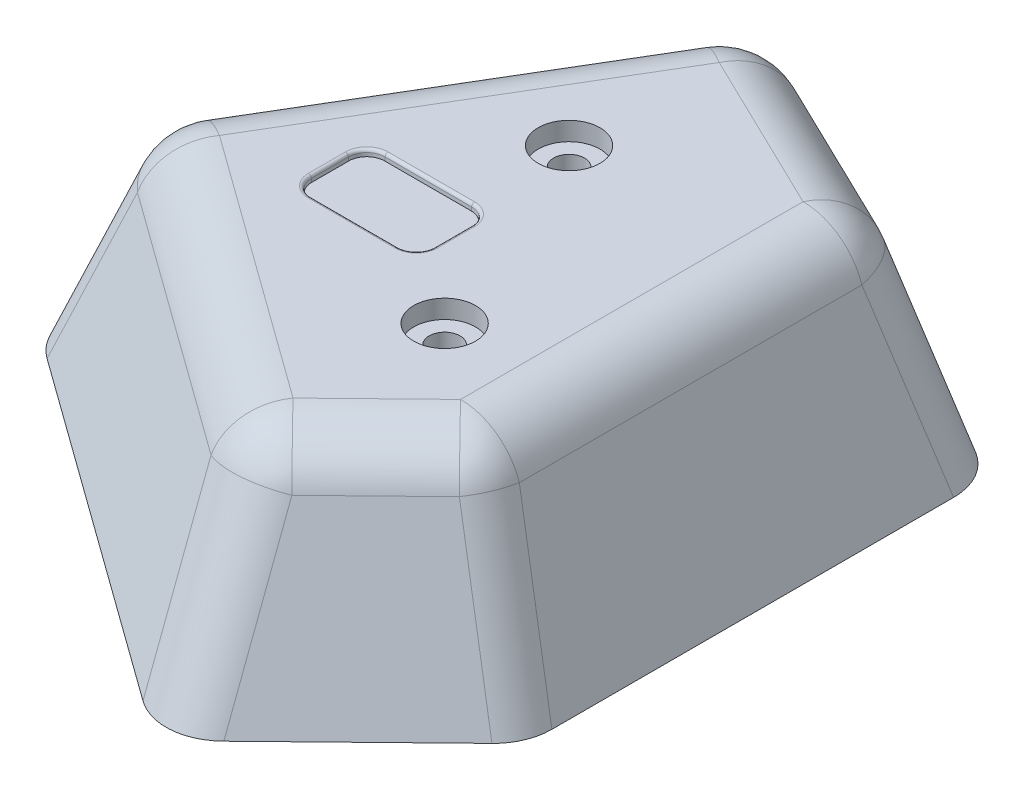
ISO-10303-21;
HEADER;
FILE_DESCRIPTION(('STEP AP214'),'2;1');
FILE_NAME('part.step','',(''),(''),'','','');
FILE_SCHEMA(('AUTOMOTIVE_DESIGN { 1 0 10303 214 1 1 1 1 }'));
ENDSEC;
DATA;
#1=APPLICATION_CONTEXT('core data for automotive mechanical design processes');
#2=APPLICATION_PROTOCOL_DEFINITION('international standard','automotive_design',2000,#1);
#3=PRODUCT_CONTEXT('',#1,'mechanical');
#4=PRODUCT('Part','Part','',(#3));
#5=PRODUCT_RELATED_PRODUCT_CATEGORY('part','',(#4));
#6=PRODUCT_DEFINITION_FORMATION('','',#4);
#7=PRODUCT_DEFINITION_CONTEXT('part definition',#1,'design');
#8=PRODUCT_DEFINITION('design','',#6,#7);
#9=PRODUCT_DEFINITION_SHAPE('','',#8);
#10=(LENGTH_UNIT() NAMED_UNIT(*) SI_UNIT(.MILLI.,.METRE.));
#11=(NAMED_UNIT(*) PLANE_ANGLE_UNIT() SI_UNIT($,.RADIAN.));
#12=(NAMED_UNIT(*) SI_UNIT($,.STERADIAN.) SOLID_ANGLE_UNIT());
#13=UNCERTAINTY_MEASURE_WITH_UNIT(LENGTH_MEASURE(1.E-05),#10,'distance_accuracy_value','');
#14=(GEOMETRIC_REPRESENTATION_CONTEXT(3) GLOBAL_UNCERTAINTY_ASSIGNED_CONTEXT((#13)) GLOBAL_UNIT_ASSIGNED_CONTEXT((#10,
#11,#12)) REPRESENTATION_CONTEXT('',''));
#15=CARTESIAN_POINT('',(0.,0.,0.));
#16=DIRECTION('',(0.,0.,1.));
#17=DIRECTION('',(1.,0.,0.));
#18=AXIS2_PLACEMENT_3D('',#15,#16,#17);
#19=CARTESIAN_POINT('',(21.602578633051,0.,83.));
#20=DIRECTION('',(0.,1.,0.));
#21=DIRECTION('',(0.,0.,1.));
#22=AXIS2_PLACEMENT_3D('',#19,#20,#21);
#23=CYLINDRICAL_SURFACE('',#22,2.5);
#24=CARTESIAN_POINT('',(21.602578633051,0.,83.));
#25=DIRECTION('',(0.,1.,0.));
#26=DIRECTION('',(0.,0.,1.));
#27=AXIS2_PLACEMENT_3D('',#24,#25,#26);
#28=CIRCLE('',#27,2.5);
#29=CARTESIAN_POINT('',(21.602578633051,0.,85.5));
#30=VERTEX_POINT('',#29);
#31=EDGE_CURVE('E258',#30,#30,#28,.T.);
#32=ORIENTED_EDGE('',*,*,#31,.F.);
#33=EDGE_LOOP('',(#32));
#34=FACE_BOUND('',#33,.T.);
#35=CARTESIAN_POINT('',(21.602578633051,32.,83.));
#36=DIRECTION('',(0.,1.,0.));
#37=DIRECTION('',(0.,0.,1.));
#38=AXIS2_PLACEMENT_3D('',#35,#36,#37);
#39=CIRCLE('',#38,2.5);
#40=CARTESIAN_POINT('',(21.602578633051,32.,85.5));
#41=VERTEX_POINT('',#40);
#42=EDGE_CURVE('E261',#41,#41,#39,.F.);
#43=ORIENTED_EDGE('',*,*,#42,.F.);
#44=EDGE_LOOP('',(#43));
#45=FACE_BOUND('',#44,.T.);
#46=ADVANCED_FACE('F32',(#34,#45),#23,.F.);
#47=CARTESIAN_POINT('',(6.74596006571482,0.,48.));
#48=DIRECTION('',(0.,1.,0.));
#49=DIRECTION('',(0.,0.,1.));
#50=AXIS2_PLACEMENT_3D('',#47,#48,#49);
#51=CYLINDRICAL_SURFACE('',#50,2.5);
#52=CARTESIAN_POINT('',(6.74596006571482,0.,48.));
#53=DIRECTION('',(0.,1.,0.));
#54=DIRECTION('',(0.,0.,1.));
#55=AXIS2_PLACEMENT_3D('',#52,#53,#54);
#56=CIRCLE('',#55,2.5);
#57=CARTESIAN_POINT('',(6.74596006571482,0.,50.5));
#58=VERTEX_POINT('',#57);
#59=EDGE_CURVE('E254',#58,#58,#56,.T.);
#60=ORIENTED_EDGE('',*,*,#59,.F.);
#61=EDGE_LOOP('',(#60));
#62=FACE_BOUND('',#61,.T.);
#63=CARTESIAN_POINT('',(6.74596006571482,32.,48.));
#64=DIRECTION('',(0.,1.,0.));
#65=DIRECTION('',(0.,0.,1.));
#66=AXIS2_PLACEMENT_3D('',#63,#64,#65);
#67=CIRCLE('',#66,2.5);
#68=CARTESIAN_POINT('',(6.74596006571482,32.,50.5));
#69=VERTEX_POINT('',#68);
#70=EDGE_CURVE('E245',#69,#69,#67,.F.);
#71=ORIENTED_EDGE('',*,*,#70,.F.);
#72=EDGE_LOOP('',(#71));
#73=FACE_BOUND('',#72,.T.);
#74=ADVANCED_FACE('F489',(#62,#73),#51,.F.);
#75=CARTESIAN_POINT('',(21.5835144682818,0.,130.));
#76=DIRECTION('',(-0.556490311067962,0.309016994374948,0.771250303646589));
#77=DIRECTION('',(0.810940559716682,0.,0.585128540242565));
#78=AXIS2_PLACEMENT_3D('',#75,#76,#77);
#79=PLANE('',#78);
#80=DIRECTION('',(-0.810940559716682,0.,-0.585128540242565));
#81=VECTOR('',#80,1.);
#82=CARTESIAN_POINT('',(21.5835144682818,0.,130.));
#83=LINE('',#82,#81);
#84=CARTESIAN_POINT('',(15.1119560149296,0.,125.330491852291));
#85=VERTEX_POINT('',#84);
#86=CARTESIAN_POINT('',(-40.6452113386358,0.,85.0992942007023));
#87=VERTEX_POINT('',#86);
#88=EDGE_CURVE('E262',#85,#87,#83,.T.);
#89=ORIENTED_EDGE('',*,*,#88,.F.);
#90=DIRECTION('',(0.0285159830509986,-0.920611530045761,0.389437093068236));
#91=VECTOR('',#90,1.);
#92=CARTESIAN_POINT('',(15.1690741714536,-1.8440056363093,126.11054312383));
#93=LINE('',#92,#91);
#94=CARTESIAN_POINT('',(14.2418617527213,28.0901699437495,113.447788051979));
#95=VERTEX_POINT('',#94);
#96=EDGE_CURVE('E318',#85,#95,#93,.F.);
#97=ORIENTED_EDGE('',*,*,#96,.T.);
#98=DIRECTION('',(-0.810940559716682,0.,-0.585128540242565));
#99=VECTOR('',#98,1.);
#100=CARTESIAN_POINT('',(-33.9213596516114,28.0901699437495,78.695949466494));
#101=LINE('',#100,#99);
#102=CARTESIAN_POINT('',(-28.5224939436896,28.0901699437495,82.5914635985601));
#103=VERTEX_POINT('',#102);
#104=EDGE_CURVE('E316',#95,#103,#101,.T.);
#105=ORIENTED_EDGE('',*,*,#104,.T.);
#106=DIRECTION('',(-0.394915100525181,-0.915078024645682,0.0816962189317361));
#107=VECTOR('',#106,1.);
#108=CARTESIAN_POINT('',(-32.3887823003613,19.1313949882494,83.3912839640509));
#109=LINE('',#108,#107);
#110=EDGE_CURVE('E314',#103,#87,#109,.T.);
#111=ORIENTED_EDGE('',*,*,#110,.T.);
#112=EDGE_LOOP('',(#89,#97,#105,#111));
#113=FACE_BOUND('',#112,.T.);
#114=ADVANCED_FACE('F495',(#113),#79,.T.);
#115=CARTESIAN_POINT('',(52.1940108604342,0.,100.245138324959));
#116=DIRECTION('',(0.662899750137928,0.309016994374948,0.681962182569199));
#117=DIRECTION('',(0.717057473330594,0.,-0.697014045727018));
#118=AXIS2_PLACEMENT_3D('',#115,#116,#117);
#119=PLANE('',#118);
#120=DIRECTION('',(-0.717057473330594,0.,0.697014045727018));
#121=VECTOR('',#120,1.);
#122=CARTESIAN_POINT('',(52.1940108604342,0.,100.245138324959));
#123=LINE('',#122,#121);
#124=CARTESIAN_POINT('',(49.3124431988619,0.,103.046159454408));
#125=VERTEX_POINT('',#124);
#126=CARTESIAN_POINT('',(27.3058566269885,0.,124.437610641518));
#127=VERTEX_POINT('',#126);
#128=EDGE_CURVE('E275',#125,#127,#123,.T.);
#129=ORIENTED_EDGE('',*,*,#128,.F.);
#130=DIRECTION('',(0.306415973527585,-0.943051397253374,0.129473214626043));
#131=VECTOR('',#130,1.);
#132=CARTESIAN_POINT('',(49.4718717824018,-0.490670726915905,103.113524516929));
#133=LINE('',#132,#131);
#134=CARTESIAN_POINT('',(40.1853937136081,28.0901699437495,99.189609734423));
#135=VERTEX_POINT('',#134);
#136=EDGE_CURVE('E312',#125,#135,#133,.F.);
#137=ORIENTED_EDGE('',*,*,#136,.T.);
#138=DIRECTION('',(-0.717057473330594,0.,0.697014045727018));
#139=VECTOR('',#138,1.);
#140=CARTESIAN_POINT('',(22.0642819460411,28.0901699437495,116.804194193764));
#141=LINE('',#140,#139);
#142=CARTESIAN_POINT('',(26.4357623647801,28.0901699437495,112.554906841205));
#143=VERTEX_POINT('',#142);
#144=EDGE_CURVE('E310',#135,#143,#141,.T.);
#145=ORIENTED_EDGE('',*,*,#144,.T.);
#146=DIRECTION('',(0.0285159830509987,-0.920611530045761,0.389437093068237));
#147=VECTOR('',#146,1.);
#148=CARTESIAN_POINT('',(27.0574329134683,8.02012452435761,121.044937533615));
#149=LINE('',#148,#147);
#150=EDGE_CURVE('E308',#143,#127,#149,.T.);
#151=ORIENTED_EDGE('',*,*,#150,.T.);
#152=EDGE_LOOP('',(#129,#137,#145,#151));
#153=FACE_BOUND('',#152,.T.);
#154=ADVANCED_FACE('F512',(#153),#119,.T.);
#155=CARTESIAN_POINT('',(52.1940108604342,0.,25.2451383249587));
#156=DIRECTION('',(0.951056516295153,0.309016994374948,0.));
#157=DIRECTION('',(-0.309016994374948,0.951056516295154,0.));
#158=AXIS2_PLACEMENT_3D('',#155,#156,#157);
#159=PLANE('',#158);
#160=DIRECTION('',(0.,0.,1.));
#161=VECTOR('',#160,1.);
#162=CARTESIAN_POINT('',(52.1940108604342,0.,25.2451383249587));
#163=LINE('',#162,#161);
#164=CARTESIAN_POINT('',(52.1940108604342,0.,31.2097085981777));
#165=VERTEX_POINT('',#164);
#166=CARTESIAN_POINT('',(52.1940108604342,0.,96.2265376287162));
#167=VERTEX_POINT('',#166);
#168=EDGE_CURVE('E272',#165,#167,#163,.T.);
#169=ORIENTED_EDGE('',*,*,#168,.F.);
#170=DIRECTION('',(0.303372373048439,-0.933684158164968,-0.190260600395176));
#171=VECTOR('',#170,1.);
#172=CARTESIAN_POINT('',(52.5382847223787,-1.05956599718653,30.9937965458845));
#173=LINE('',#172,#171);
#174=CARTESIAN_POINT('',(43.0669613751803,28.0901699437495,36.9337562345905));
#175=VERTEX_POINT('',#174);
#176=EDGE_CURVE('E306',#165,#175,#173,.F.);
#177=ORIENTED_EDGE('',*,*,#176,.T.);
#178=DIRECTION('',(0.,0.,1.));
#179=VECTOR('',#178,1.);
#180=CARTESIAN_POINT('',(43.0669613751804,28.0901699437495,95.4399256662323));
#181=LINE('',#180,#179);
#182=CARTESIAN_POINT('',(43.0669613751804,28.0901699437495,92.369987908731));
#183=VERTEX_POINT('',#182);
#184=EDGE_CURVE('E304',#175,#183,#181,.T.);
#185=ORIENTED_EDGE('',*,*,#184,.T.);
#186=DIRECTION('',(0.306415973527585,-0.943051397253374,0.129473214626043));
#187=VECTOR('',#186,1.);
#188=CARTESIAN_POINT('',(49.3779898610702,8.6668214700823,95.0366541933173));
#189=LINE('',#188,#187);
#190=EDGE_CURVE('E302',#183,#167,#189,.T.);
#191=ORIENTED_EDGE('',*,*,#190,.T.);
#192=EDGE_LOOP('',(#169,#177,#185,#191));
#193=FACE_BOUND('',#192,.T.);
#194=ADVANCED_FACE('F520',(#193),#159,.T.);
#195=CARTESIAN_POINT('',(0.,0.,0.));
#196=DIRECTION('',(0.414109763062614,0.309016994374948,-0.856166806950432));
#197=DIRECTION('',(-0.900227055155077,0.,-0.435420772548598));
#198=AXIS2_PLACEMENT_3D('',#195,#196,#197);
#199=PLANE('',#198);
#200=DIRECTION('',(0.900227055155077,0.,0.435420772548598));
#201=VECTOR('',#200,1.);
#202=CARTESIAN_POINT('',(0.,0.,0.));
#203=LINE('',#202,#201);
#204=CARTESIAN_POINT('',(7.8453233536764,0.,3.79461685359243));
#205=VERTEX_POINT('',#204);
#206=CARTESIAN_POINT('',(46.8245433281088,0.,22.6480405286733));
#207=VERTEX_POINT('',#206);
#208=EDGE_CURVE('E269',#205,#207,#203,.T.);
#209=ORIENTED_EDGE('',*,*,#208,.F.);
#210=DIRECTION('',(-0.115804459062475,-0.915078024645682,-0.386292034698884));
#211=VECTOR('',#210,1.);
#212=CARTESIAN_POINT('',(7.57036260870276,-2.1727188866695,2.87742293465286));
#213=LINE('',#212,#211);
#214=CARTESIAN_POINT('',(11.4001753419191,28.0901699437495,15.6526318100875));
#215=VERTEX_POINT('',#214);
#216=EDGE_CURVE('E300',#205,#215,#213,.F.);
#217=ORIENTED_EDGE('',*,*,#216,.T.);
#218=DIRECTION('',(0.900227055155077,0.,0.435420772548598));
#219=VECTOR('',#218,1.);
#220=CARTESIAN_POINT('',(41.7994020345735,28.0901699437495,30.3560943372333));
#221=LINE('',#220,#219);
#222=CARTESIAN_POINT('',(37.697493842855,28.0901699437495,28.3720881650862));
#223=VERTEX_POINT('',#222);
#224=EDGE_CURVE('E298',#215,#223,#221,.T.);
#225=ORIENTED_EDGE('',*,*,#224,.T.);
#226=DIRECTION('',(0.303372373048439,-0.933684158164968,-0.190260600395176));
#227=VECTOR('',#226,1.);
#228=CARTESIAN_POINT('',(43.8222965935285,9.23996534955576,24.5309056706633));
#229=LINE('',#228,#227);
#230=EDGE_CURVE('E296',#223,#207,#229,.T.);
#231=ORIENTED_EDGE('',*,*,#230,.T.);
#232=EDGE_LOOP('',(#209,#217,#225,#231));
#233=FACE_BOUND('',#232,.T.);
#234=ADVANCED_FACE('F516',(#233),#199,.T.);
#235=CARTESIAN_POINT('',(-47.7124183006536,0.,80.));
#236=DIRECTION('',(-0.816816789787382,0.309016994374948,-0.487153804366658));
#237=DIRECTION('',(-0.5122238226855,0.,0.858851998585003));
#238=AXIS2_PLACEMENT_3D('',#235,#236,#237);
#239=PLANE('',#238);
#240=DIRECTION('',(0.5122238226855,0.,-0.858851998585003));
#241=VECTOR('',#240,1.);
#242=CARTESIAN_POINT('',(2.50105818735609,28.0901699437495,13.62492401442));
#243=LINE('',#242,#241);
#244=CARTESIAN_POINT('',(-31.1257587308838,28.0901699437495,70.0074225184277));
#245=VERTEX_POINT('',#244);
#246=CARTESIAN_POINT('',(-0.909090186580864,28.0901699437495,19.3427618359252));
#247=VERTEX_POINT('',#246);
#248=EDGE_CURVE('E280',#245,#247,#243,.T.);
#249=ORIENTED_EDGE('',*,*,#248,.T.);
#250=DIRECTION('',(-0.115804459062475,-0.915078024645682,-0.386292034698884));
#251=VECTOR('',#250,1.);
#252=CARTESIAN_POINT('',(-1.80001133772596,21.0501787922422,16.3708922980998));
#253=LINE('',#252,#251);
#254=CARTESIAN_POINT('',(-4.46394217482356,0.,7.48474687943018));
#255=VERTEX_POINT('',#254);
#256=EDGE_CURVE('E283',#247,#255,#253,.T.);
#257=ORIENTED_EDGE('',*,*,#256,.T.);
#258=DIRECTION('',(0.5122238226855,0.,-0.858851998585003));
#259=VECTOR('',#258,1.);
#260=CARTESIAN_POINT('',(-47.7124183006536,0.,80.));
#261=LINE('',#260,#259);
#262=CARTESIAN_POINT('',(-43.2484761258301,0.,72.5152531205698));
#263=VERTEX_POINT('',#262);
#264=EDGE_CURVE('E265',#263,#255,#261,.T.);
#265=ORIENTED_EDGE('',*,*,#264,.F.);
#266=DIRECTION('',(-0.394915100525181,-0.915078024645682,0.0816962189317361));
#267=VECTOR('',#266,1.);
#268=CARTESIAN_POINT('',(-44.1861442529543,-2.17271888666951,72.7092288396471));
#269=LINE('',#268,#267);
#270=EDGE_CURVE('E278',#263,#245,#269,.F.);
#271=ORIENTED_EDGE('',*,*,#270,.T.);
#272=EDGE_LOOP('',(#249,#257,#265,#271));
#273=FACE_BOUND('',#272,.T.);
#274=ADVANCED_FACE('F505',(#273),#239,.T.);
#275=CARTESIAN_POINT('',(0.,35.,0.));
#276=DIRECTION('',(0.,-1.,0.));
#277=DIRECTION('',(0.,0.,-1.));
#278=AXIS2_PLACEMENT_3D('',#275,#276,#277);
#279=PLANE('',#278);
#280=CARTESIAN_POINT('',(7.00000000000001,35.,67.));
#281=DIRECTION('',(0.,-1.,0.));
#282=DIRECTION('',(0.,0.,-1.));
#283=AXIS2_PLACEMENT_3D('',#280,#281,#282);
#284=CIRCLE('',#283,3.45816558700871);
#285=CARTESIAN_POINT('',(6.99999999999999,35.,63.5418344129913));
#286=VERTEX_POINT('',#285);
#287=CARTESIAN_POINT('',(10.4581655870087,35.,67.));
#288=VERTEX_POINT('',#287);
#289=EDGE_CURVE('E378',#286,#288,#284,.T.);
#290=ORIENTED_EDGE('',*,*,#289,.T.);
#291=DIRECTION('',(0.,0.,-1.));
#292=VECTOR('',#291,1.);
#293=CARTESIAN_POINT('',(10.4581655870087,35.,0.));
#294=LINE('',#293,#292);
#295=CARTESIAN_POINT('',(10.4581655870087,35.,73.));
#296=VERTEX_POINT('',#295);
#297=EDGE_CURVE('E392',#288,#296,#294,.F.);
#298=ORIENTED_EDGE('',*,*,#297,.T.);
#299=CARTESIAN_POINT('',(7.00000000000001,35.,73.));
#300=DIRECTION('',(0.,-1.,0.));
#301=DIRECTION('',(0.,0.,-1.));
#302=AXIS2_PLACEMENT_3D('',#299,#300,#301);
#303=CIRCLE('',#302,3.45816558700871);
#304=CARTESIAN_POINT('',(6.99999999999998,35.,76.4581655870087));
#305=VERTEX_POINT('',#304);
#306=EDGE_CURVE('E390',#296,#305,#303,.T.);
#307=ORIENTED_EDGE('',*,*,#306,.T.);
#308=DIRECTION('',(1.,0.,0.));
#309=VECTOR('',#308,1.);
#310=CARTESIAN_POINT('',(0.,35.,76.4581655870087));
#311=LINE('',#310,#309);
#312=CARTESIAN_POINT('',(-6.99999999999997,35.,76.4581655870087));
#313=VERTEX_POINT('',#312);
#314=EDGE_CURVE('E388',#305,#313,#311,.F.);
#315=ORIENTED_EDGE('',*,*,#314,.T.);
#316=CARTESIAN_POINT('',(-6.99999999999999,35.,73.));
#317=DIRECTION('',(0.,-1.,0.));
#318=DIRECTION('',(0.,0.,-1.));
#319=AXIS2_PLACEMENT_3D('',#316,#317,#318);
#320=CIRCLE('',#319,3.45816558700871);
#321=CARTESIAN_POINT('',(-10.4581655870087,35.,73.));
#322=VERTEX_POINT('',#321);
#323=EDGE_CURVE('E386',#313,#322,#320,.T.);
#324=ORIENTED_EDGE('',*,*,#323,.T.);
#325=DIRECTION('',(0.,0.,1.));
#326=VECTOR('',#325,1.);
#327=CARTESIAN_POINT('',(-10.4581655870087,35.,0.));
#328=LINE('',#327,#326);
#329=CARTESIAN_POINT('',(-10.4581655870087,35.,67.));
#330=VERTEX_POINT('',#329);
#331=EDGE_CURVE('E384',#322,#330,#328,.F.);
#332=ORIENTED_EDGE('',*,*,#331,.T.);
#333=CARTESIAN_POINT('',(-6.99999999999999,35.,67.));
#334=DIRECTION('',(0.,-1.,0.));
#335=DIRECTION('',(0.,0.,-1.));
#336=AXIS2_PLACEMENT_3D('',#333,#334,#335);
#337=CIRCLE('',#336,3.45816558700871);
#338=CARTESIAN_POINT('',(-6.99999999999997,35.,63.5418344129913));
#339=VERTEX_POINT('',#338);
#340=EDGE_CURVE('E382',#330,#339,#337,.T.);
#341=ORIENTED_EDGE('',*,*,#340,.T.);
#342=DIRECTION('',(-1.,0.,0.));
#343=VECTOR('',#342,1.);
#344=CARTESIAN_POINT('',(0.,35.,63.5418344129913));
#345=LINE('',#344,#343);
#346=EDGE_CURVE('E380',#339,#286,#345,.F.);
#347=ORIENTED_EDGE('',*,*,#346,.T.);
#348=EDGE_LOOP('',(#290,#298,#307,#315,#324,#332,#341,#347));
#349=FACE_BOUND('',#348,.T.);
#350=CARTESIAN_POINT('',(6.74596006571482,35.,48.));
#351=DIRECTION('',(0.,1.,0.));
#352=DIRECTION('',(0.,0.,1.));
#353=AXIS2_PLACEMENT_3D('',#350,#351,#352);
#354=CIRCLE('',#353,5.);
#355=CARTESIAN_POINT('',(6.74596006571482,35.,53.));
#356=VERTEX_POINT('',#355);
#357=EDGE_CURVE('E246',#356,#356,#354,.T.);
#358=ORIENTED_EDGE('',*,*,#357,.F.);
#359=EDGE_LOOP('',(#358));
#360=FACE_BOUND('',#359,.T.);
#361=CARTESIAN_POINT('',(21.602578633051,35.,83.));
#362=DIRECTION('',(0.,1.,0.));
#363=DIRECTION('',(0.,0.,1.));
#364=AXIS2_PLACEMENT_3D('',#361,#362,#363);
#365=CIRCLE('',#364,5.);
#366=CARTESIAN_POINT('',(21.602578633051,35.,88.));
#367=VERTEX_POINT('',#366);
#368=EDGE_CURVE('E206',#367,#367,#365,.T.);
#369=ORIENTED_EDGE('',*,*,#368,.F.);
#370=EDGE_LOOP('',(#369));
#371=FACE_BOUND('',#370,.T.);
#372=DIRECTION('',(0.900227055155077,0.,0.435420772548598));
#373=VECTOR('',#372,1.);
#374=CARTESIAN_POINT('',(1.26578397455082,35.,21.3154705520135));
#375=LINE('',#374,#373);
#376=CARTESIAN_POINT('',(33.5563962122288,35.,36.9337562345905));
#377=VERTEX_POINT('',#376);
#378=CARTESIAN_POINT('',(7.25907771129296,35.,24.2142998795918));
#379=VERTEX_POINT('',#378);
#380=EDGE_CURVE('E291',#377,#379,#375,.F.);
#381=ORIENTED_EDGE('',*,*,#380,.T.);
#382=DIRECTION('',(0.5122238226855,0.,-0.858851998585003));
#383=VECTOR('',#382,1.);
#384=CARTESIAN_POINT('',(-26.3677392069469,35.,80.5967983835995));
#385=LINE('',#384,#383);
#386=CARTESIAN_POINT('',(-22.95759083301,35.,74.8789605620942));
#387=VERTEX_POINT('',#386);
#388=EDGE_CURVE('E293',#379,#387,#385,.F.);
#389=ORIENTED_EDGE('',*,*,#388,.T.);
#390=DIRECTION('',(-0.810940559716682,0.,-0.585128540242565));
#391=VECTOR('',#390,1.);
#392=CARTESIAN_POINT('',(24.7505956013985,35.,109.302471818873));
#393=LINE('',#392,#391);
#394=CARTESIAN_POINT('',(19.8067648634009,35.,105.735285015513));
#395=VERTEX_POINT('',#394);
#396=EDGE_CURVE('E285',#387,#395,#393,.F.);
#397=ORIENTED_EDGE('',*,*,#396,.T.);
#398=DIRECTION('',(-0.717057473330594,0.,0.697014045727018));
#399=VECTOR('',#398,1.);
#400=CARTESIAN_POINT('',(35.7577180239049,35.,90.2301981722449));
#401=LINE('',#400,#399);
#402=CARTESIAN_POINT('',(33.5563962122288,35.,92.369987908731));
#403=VERTEX_POINT('',#402);
#404=EDGE_CURVE('E287',#395,#403,#401,.F.);
#405=ORIENTED_EDGE('',*,*,#404,.T.);
#406=DIRECTION('',(0.,0.,1.));
#407=VECTOR('',#406,1.);
#408=CARTESIAN_POINT('',(33.5563962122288,35.,32.3772300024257));
#409=LINE('',#408,#407);
#410=EDGE_CURVE('E289',#403,#377,#409,.F.);
#411=ORIENTED_EDGE('',*,*,#410,.T.);
#412=EDGE_LOOP('',(#381,#389,#397,#405,#411));
#413=FACE_BOUND('',#412,.T.);
#414=ADVANCED_FACE('F435',(#349,#360,#371,#413),#279,.F.);
#415=CARTESIAN_POINT('',(0.,0.,0.));
#416=DIRECTION('',(0.,-1.,0.));
#417=DIRECTION('',(0.,0.,-1.));
#418=AXIS2_PLACEMENT_3D('',#415,#416,#417);
#419=PLANE('',#418);
#420=ORIENTED_EDGE('',*,*,#59,.T.);
#421=EDGE_LOOP('',(#420));
#422=FACE_BOUND('',#421,.T.);
#423=ORIENTED_EDGE('',*,*,#31,.T.);
#424=EDGE_LOOP('',(#423));
#425=FACE_BOUND('',#424,.T.);
#426=ORIENTED_EDGE('',*,*,#264,.T.);
#427=CARTESIAN_POINT('',(4.09529123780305,0.,13.6607726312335));
#428=DIRECTION('',(0.,-1.,0.));
#429=DIRECTION('',(-0.287158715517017,0.,-0.957883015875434));
#430=AXIS2_PLACEMENT_3D('',#427,#428,#429);
#431=ELLIPSE('',#430,10.9280298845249,10.);
#432=EDGE_CURVE('E328',#255,#205,#431,.T.);
#433=ORIENTED_EDGE('',*,*,#432,.T.);
#434=ORIENTED_EDGE('',*,*,#208,.T.);
#435=CARTESIAN_POINT('',(41.6793886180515,0.,31.8394050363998));
#436=DIRECTION('',(0.,-1.,0.));
#437=DIRECTION('',(0.847177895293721,0.,-0.531309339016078));
#438=AXIS2_PLACEMENT_3D('',#435,#436,#437);
#439=ELLIPSE('',#438,10.7102599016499,10.);
#440=EDGE_CURVE('E326',#207,#165,#439,.T.);
#441=ORIENTED_EDGE('',*,*,#440,.T.);
#442=ORIENTED_EDGE('',*,*,#168,.T.);
#443=CARTESIAN_POINT('',(41.6793886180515,0.,95.8022826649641));
#444=DIRECTION('',(0.,-1.,0.));
#445=DIRECTION('',(0.921144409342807,0.,0.389220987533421));
#446=AXIS2_PLACEMENT_3D('',#443,#444,#445);
#447=ELLIPSE('',#446,10.6038759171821,10.);
#448=EDGE_CURVE('E324',#167,#125,#447,.T.);
#449=ORIENTED_EDGE('',*,*,#448,.T.);
#450=ORIENTED_EDGE('',*,*,#128,.T.);
#451=CARTESIAN_POINT('',(20.5811409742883,0.,116.310785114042));
#452=DIRECTION('',(0.,-1.,0.));
#453=DIRECTION('',(0.0730280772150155,0.,0.99732988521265));
#454=AXIS2_PLACEMENT_3D('',#451,#452,#453);
#455=ELLIPSE('',#454,10.8623449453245,10.);
#456=EDGE_CURVE('E322',#127,#85,#455,.T.);
#457=ORIENTED_EDGE('',*,*,#456,.T.);
#458=ORIENTED_EDGE('',*,*,#88,.T.);
#459=CARTESIAN_POINT('',(-33.7467008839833,0.,77.110907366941));
#460=DIRECTION('',(0.,-1.,0.));
#461=DIRECTION('',(-0.979265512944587,0.,0.202580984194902));
#462=AXIS2_PLACEMENT_3D('',#459,#460,#461);
#463=ELLIPSE('',#462,10.9280298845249,10.);
#464=EDGE_CURVE('E320',#87,#263,#463,.T.);
#465=ORIENTED_EDGE('',*,*,#464,.T.);
#466=EDGE_LOOP('',(#426,#433,#434,#441,#442,#449,#450,#457,#458,#465));
#467=FACE_BOUND('',#466,.T.);
#468=ADVANCED_FACE('F504',(#422,#425,#467),#419,.T.);
#469=CARTESIAN_POINT('',(39.8674246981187,5.57665152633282,95.0366541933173));
#470=DIRECTION('',(0.306415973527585,-0.943051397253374,0.129473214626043));
#471=DIRECTION('',(0.951056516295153,0.309016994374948,0.));
#472=AXIS2_PLACEMENT_3D('',#469,#470,#471);
#473=CYLINDRICAL_SURFACE('',#472,10.);
#474=CARTESIAN_POINT('',(33.5563962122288,25.,92.369987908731));
#475=DIRECTION('',(-0.306415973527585,0.943051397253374,-0.129473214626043));
#476=DIRECTION('',(-0.951056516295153,-0.309016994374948,0.));
#477=AXIS2_PLACEMENT_3D('',#474,#475,#476);
#478=CIRCLE('',#477,10.);
#479=EDGE_CURVE('E266',#135,#183,#478,.T.);
#480=ORIENTED_EDGE('',*,*,#479,.F.);
#481=ORIENTED_EDGE('',*,*,#136,.F.);
#482=ORIENTED_EDGE('',*,*,#448,.F.);
#483=ORIENTED_EDGE('',*,*,#190,.F.);
#484=EDGE_LOOP('',(#480,#481,#482,#483));
#485=FACE_BOUND('',#484,.T.);
#486=ADVANCED_FACE('F508',(#485),#473,.T.);
#487=CARTESIAN_POINT('',(33.5563962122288,25.,92.369987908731));
#488=DIRECTION('',(0.,0.,1.));
#489=DIRECTION('',(1.,0.,0.));
#490=AXIS2_PLACEMENT_3D('',#487,#488,#489);
#491=SPHERICAL_SURFACE('',#490,10.);
#492=CARTESIAN_POINT('',(33.5563962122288,25.,92.369987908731));
#493=DIRECTION('',(0.,0.,1.));
#494=DIRECTION('',(1.,0.,0.));
#495=AXIS2_PLACEMENT_3D('',#492,#493,#494);
#496=CIRCLE('',#495,10.);
#497=EDGE_CURVE('E364',#403,#183,#496,.F.);
#498=ORIENTED_EDGE('',*,*,#497,.F.);
#499=CARTESIAN_POINT('',(33.5563962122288,25.,92.369987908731));
#500=DIRECTION('',(0.717057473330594,0.,-0.697014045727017));
#501=DIRECTION('',(-0.697014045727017,0.,-0.717057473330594));
#502=AXIS2_PLACEMENT_3D('',#499,#500,#501);
#503=CIRCLE('',#502,10.);
#504=EDGE_CURVE('E367',#135,#403,#503,.F.);
#505=ORIENTED_EDGE('',*,*,#504,.F.);
#506=ORIENTED_EDGE('',*,*,#479,.T.);
#507=EDGE_LOOP('',(#498,#505,#506));
#508=FACE_BOUND('',#507,.T.);
#509=ADVANCED_FACE('F580',(#508),#491,.T.);
#510=CARTESIAN_POINT('',(39.2033316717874,25.,86.8808974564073));
#511=DIRECTION('',(0.717057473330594,0.,-0.697014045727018));
#512=DIRECTION('',(-0.697014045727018,0.,-0.717057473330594));
#513=AXIS2_PLACEMENT_3D('',#510,#511,#512);
#514=CYLINDRICAL_SURFACE('',#513,10.);
#515=ORIENTED_EDGE('',*,*,#504,.T.);
#516=ORIENTED_EDGE('',*,*,#404,.F.);
#517=CARTESIAN_POINT('',(19.8067648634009,25.,105.735285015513));
#518=DIRECTION('',(-0.717057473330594,0.,0.697014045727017));
#519=DIRECTION('',(0.697014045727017,0.,0.717057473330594));
#520=AXIS2_PLACEMENT_3D('',#517,#518,#519);
#521=CIRCLE('',#520,10.);
#522=EDGE_CURVE('E361',#143,#395,#521,.T.);
#523=ORIENTED_EDGE('',*,*,#522,.F.);
#524=ORIENTED_EDGE('',*,*,#144,.F.);
#525=EDGE_LOOP('',(#515,#516,#523,#524));
#526=FACE_BOUND('',#525,.T.);
#527=ADVANCED_FACE('F576',(#526),#514,.T.);
#528=CARTESIAN_POINT('',(20.428435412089,4.92995458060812,114.225315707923));
#529=DIRECTION('',(0.0285159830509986,-0.920611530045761,0.389437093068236));
#530=DIRECTION('',(0.,-0.389595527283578,-0.920986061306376));
#531=AXIS2_PLACEMENT_3D('',#528,#529,#530);
#532=CYLINDRICAL_SURFACE('',#531,10.);
#533=ORIENTED_EDGE('',*,*,#456,.F.);
#534=ORIENTED_EDGE('',*,*,#150,.F.);
#535=CARTESIAN_POINT('',(19.8067648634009,25.,105.735285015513));
#536=DIRECTION('',(-0.0285159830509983,0.920611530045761,-0.389437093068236));
#537=DIRECTION('',(0.,0.389595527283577,0.920986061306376));
#538=AXIS2_PLACEMENT_3D('',#535,#536,#537);
#539=CIRCLE('',#538,10.);
#540=EDGE_CURVE('E358',#95,#143,#539,.T.);
#541=ORIENTED_EDGE('',*,*,#540,.F.);
#542=ORIENTED_EDGE('',*,*,#96,.F.);
#543=EDGE_LOOP('',(#533,#534,#541,#542));
#544=FACE_BOUND('',#543,.T.);
#545=ADVANCED_FACE('F572',(#544),#532,.T.);
#546=CARTESIAN_POINT('',(39.6811989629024,6.14979540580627,33.0925737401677));
#547=DIRECTION('',(0.303372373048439,-0.933684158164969,-0.190260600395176));
#548=DIRECTION('',(0.951056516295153,0.309016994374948,0.));
#549=AXIS2_PLACEMENT_3D('',#546,#547,#548);
#550=CYLINDRICAL_SURFACE('',#549,10.);
#551=ORIENTED_EDGE('',*,*,#440,.F.);
#552=ORIENTED_EDGE('',*,*,#230,.F.);
#553=CARTESIAN_POINT('',(33.5563962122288,25.,36.9337562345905));
#554=DIRECTION('',(-0.303372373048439,0.933684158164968,0.190260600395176));
#555=DIRECTION('',(-0.951056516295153,-0.309016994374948,0.));
#556=AXIS2_PLACEMENT_3D('',#553,#554,#555);
#557=CIRCLE('',#556,10.);
#558=EDGE_CURVE('E355',#175,#223,#557,.T.);
#559=ORIENTED_EDGE('',*,*,#558,.F.);
#560=ORIENTED_EDGE('',*,*,#176,.F.);
#561=EDGE_LOOP('',(#551,#552,#559,#560));
#562=FACE_BOUND('',#561,.T.);
#563=ADVANCED_FACE('F568',(#562),#550,.T.);
#564=CARTESIAN_POINT('',(33.5563962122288,25.,25.2451383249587));
#565=DIRECTION('',(0.,0.,-1.));
#566=DIRECTION('',(-1.,0.,0.));
#567=AXIS2_PLACEMENT_3D('',#564,#565,#566);
#568=CYLINDRICAL_SURFACE('',#567,10.);
#569=ORIENTED_EDGE('',*,*,#497,.T.);
#570=ORIENTED_EDGE('',*,*,#184,.F.);
#571=CARTESIAN_POINT('',(33.5563962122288,25.,36.9337562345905));
#572=DIRECTION('',(0.,0.,-1.));
#573=DIRECTION('',(-1.,0.,0.));
#574=AXIS2_PLACEMENT_3D('',#571,#572,#573);
#575=CIRCLE('',#574,10.);
#576=EDGE_CURVE('E352',#377,#175,#575,.T.);
#577=ORIENTED_EDGE('',*,*,#576,.F.);
#578=ORIENTED_EDGE('',*,*,#410,.F.);
#579=EDGE_LOOP('',(#569,#570,#577,#578));
#580=FACE_BOUND('',#579,.T.);
#581=ADVANCED_FACE('F564',(#580),#568,.T.);
#582=CARTESIAN_POINT('',(19.8067648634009,25.,105.735285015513));
#583=DIRECTION('',(0.,0.,1.));
#584=DIRECTION('',(1.,0.,0.));
#585=AXIS2_PLACEMENT_3D('',#582,#583,#584);
#586=SPHERICAL_SURFACE('',#585,10.);
#587=ORIENTED_EDGE('',*,*,#540,.T.);
#588=ORIENTED_EDGE('',*,*,#522,.T.);
#589=CARTESIAN_POINT('',(19.8067648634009,25.,105.735285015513));
#590=DIRECTION('',(0.810940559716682,0.,0.585128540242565));
#591=DIRECTION('',(0.585128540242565,0.,-0.810940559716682));
#592=AXIS2_PLACEMENT_3D('',#589,#590,#591);
#593=CIRCLE('',#592,10.);
#594=EDGE_CURVE('E349',#95,#395,#593,.F.);
#595=ORIENTED_EDGE('',*,*,#594,.F.);
#596=EDGE_LOOP('',(#587,#588,#595));
#597=FACE_BOUND('',#596,.T.);
#598=ADVANCED_FACE('F560',(#597),#586,.T.);
#599=CARTESIAN_POINT('',(33.5563962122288,25.,36.9337562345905));
#600=DIRECTION('',(0.,0.,1.));
#601=DIRECTION('',(1.,0.,0.));
#602=AXIS2_PLACEMENT_3D('',#599,#600,#601);
#603=SPHERICAL_SURFACE('',#602,10.);
#604=ORIENTED_EDGE('',*,*,#576,.T.);
#605=ORIENTED_EDGE('',*,*,#558,.T.);
#606=CARTESIAN_POINT('',(33.5563962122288,25.,36.9337562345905));
#607=DIRECTION('',(0.900227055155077,0.,0.435420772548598));
#608=DIRECTION('',(0.435420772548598,0.,-0.900227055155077));
#609=AXIS2_PLACEMENT_3D('',#606,#607,#608);
#610=CIRCLE('',#609,10.);
#611=EDGE_CURVE('E346',#377,#223,#610,.F.);
#612=ORIENTED_EDGE('',*,*,#611,.F.);
#613=EDGE_LOOP('',(#604,#605,#612));
#614=FACE_BOUND('',#613,.T.);
#615=ADVANCED_FACE('F556',(#614),#603,.T.);
#616=CARTESIAN_POINT('',(32.4889147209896,25.,114.886002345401));
#617=DIRECTION('',(0.810940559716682,0.,0.585128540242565));
#618=DIRECTION('',(0.585128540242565,0.,-0.810940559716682));
#619=AXIS2_PLACEMENT_3D('',#616,#617,#618);
#620=CYLINDRICAL_SURFACE('',#619,10.);
#621=ORIENTED_EDGE('',*,*,#594,.T.);
#622=ORIENTED_EDGE('',*,*,#396,.F.);
#623=CARTESIAN_POINT('',(-22.95759083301,25.,74.8789605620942));
#624=DIRECTION('',(-0.810940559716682,0.,-0.585128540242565));
#625=DIRECTION('',(-0.585128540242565,0.,0.810940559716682));
#626=AXIS2_PLACEMENT_3D('',#623,#624,#625);
#627=CIRCLE('',#626,10.);
#628=EDGE_CURVE('E343',#103,#387,#627,.T.);
#629=ORIENTED_EDGE('',*,*,#628,.F.);
#630=ORIENTED_EDGE('',*,*,#104,.F.);
#631=EDGE_LOOP('',(#621,#622,#629,#630));
#632=FACE_BOUND('',#631,.T.);
#633=ADVANCED_FACE('F552',(#632),#620,.T.);
#634=CARTESIAN_POINT('',(-26.8238791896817,16.0412250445,75.678780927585));
#635=DIRECTION('',(-0.394915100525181,-0.915078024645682,0.0816962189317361));
#636=DIRECTION('',(0.9181471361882,-0.396239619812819,0.));
#637=AXIS2_PLACEMENT_3D('',#634,#635,#636);
#638=CYLINDRICAL_SURFACE('',#637,10.);
#639=ORIENTED_EDGE('',*,*,#464,.F.);
#640=ORIENTED_EDGE('',*,*,#110,.F.);
#641=CARTESIAN_POINT('',(-22.95759083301,25.,74.8789605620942));
#642=DIRECTION('',(0.394915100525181,0.915078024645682,-0.0816962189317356));
#643=DIRECTION('',(-0.9181471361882,0.396239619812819,0.));
#644=AXIS2_PLACEMENT_3D('',#641,#642,#643);
#645=CIRCLE('',#644,10.);
#646=EDGE_CURVE('E340',#245,#103,#645,.T.);
#647=ORIENTED_EDGE('',*,*,#646,.F.);
#648=ORIENTED_EDGE('',*,*,#270,.F.);
#649=EDGE_LOOP('',(#639,#640,#647,#648));
#650=FACE_BOUND('',#649,.T.);
#651=ADVANCED_FACE('F548',(#650),#638,.T.);
#652=CARTESIAN_POINT('',(6.36815656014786,17.9600088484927,21.2424303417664));
#653=DIRECTION('',(-0.115804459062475,-0.915078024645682,-0.386292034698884));
#654=DIRECTION('',(0.,0.388908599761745,-0.921276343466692));
#655=AXIS2_PLACEMENT_3D('',#652,#653,#654);
#656=CYLINDRICAL_SURFACE('',#655,10.);
#657=ORIENTED_EDGE('',*,*,#432,.F.);
#658=ORIENTED_EDGE('',*,*,#256,.F.);
#659=CARTESIAN_POINT('',(7.25907771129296,25.,24.2142998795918));
#660=DIRECTION('',(0.115804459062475,0.915078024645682,0.386292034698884));
#661=DIRECTION('',(0.,-0.388908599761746,0.921276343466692));
#662=AXIS2_PLACEMENT_3D('',#659,#660,#661);
#663=CIRCLE('',#662,10.);
#664=EDGE_CURVE('E337',#215,#247,#663,.T.);
#665=ORIENTED_EDGE('',*,*,#664,.F.);
#666=ORIENTED_EDGE('',*,*,#216,.F.);
#667=EDGE_LOOP('',(#657,#658,#665,#666));
#668=FACE_BOUND('',#667,.T.);
#669=ADVANCED_FACE('F544',(#668),#656,.T.);
#670=CARTESIAN_POINT('',(-8.11520456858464,25.,16.778084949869));
#671=DIRECTION('',(-0.900227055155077,0.,-0.435420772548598));
#672=DIRECTION('',(-0.435420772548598,0.,0.900227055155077));
#673=AXIS2_PLACEMENT_3D('',#670,#671,#672);
#674=CYLINDRICAL_SURFACE('',#673,10.);
#675=ORIENTED_EDGE('',*,*,#611,.T.);
#676=ORIENTED_EDGE('',*,*,#224,.F.);
#677=CARTESIAN_POINT('',(7.25907771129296,25.,24.2142998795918));
#678=DIRECTION('',(-0.900227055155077,0.,-0.435420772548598));
#679=DIRECTION('',(-0.435420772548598,0.,0.900227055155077));
#680=AXIS2_PLACEMENT_3D('',#677,#678,#679);
#681=CIRCLE('',#680,10.);
#682=EDGE_CURVE('E334',#379,#215,#681,.T.);
#683=ORIENTED_EDGE('',*,*,#682,.F.);
#684=ORIENTED_EDGE('',*,*,#380,.F.);
#685=EDGE_LOOP('',(#675,#676,#683,#684));
#686=FACE_BOUND('',#685,.T.);
#687=ADVANCED_FACE('F540',(#686),#674,.T.);
#688=CARTESIAN_POINT('',(-22.95759083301,25.,74.8789605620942));
#689=DIRECTION('',(0.,0.,1.));
#690=DIRECTION('',(1.,0.,0.));
#691=AXIS2_PLACEMENT_3D('',#688,#689,#690);
#692=SPHERICAL_SURFACE('',#691,10.);
#693=ORIENTED_EDGE('',*,*,#646,.T.);
#694=ORIENTED_EDGE('',*,*,#628,.T.);
#695=CARTESIAN_POINT('',(-22.95759083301,25.,74.8789605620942));
#696=DIRECTION('',(-0.512223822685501,0.,0.858851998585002));
#697=DIRECTION('',(0.858851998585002,0.,0.512223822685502));
#698=AXIS2_PLACEMENT_3D('',#695,#696,#697);
#699=CIRCLE('',#698,10.);
#700=EDGE_CURVE('E332',#245,#387,#699,.F.);
#701=ORIENTED_EDGE('',*,*,#700,.F.);
#702=EDGE_LOOP('',(#693,#694,#701));
#703=FACE_BOUND('',#702,.T.);
#704=ADVANCED_FACE('F536',(#703),#692,.T.);
#705=CARTESIAN_POINT('',(7.25907771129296,25.,24.2142998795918));
#706=DIRECTION('',(0.,0.,1.));
#707=DIRECTION('',(1.,0.,0.));
#708=AXIS2_PLACEMENT_3D('',#705,#706,#707);
#709=SPHERICAL_SURFACE('',#708,10.);
#710=ORIENTED_EDGE('',*,*,#682,.T.);
#711=ORIENTED_EDGE('',*,*,#664,.T.);
#712=CARTESIAN_POINT('',(7.25907771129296,25.,24.2142998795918));
#713=DIRECTION('',(0.5122238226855,0.,-0.858851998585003));
#714=DIRECTION('',(-0.858851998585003,0.,-0.5122238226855));
#715=AXIS2_PLACEMENT_3D('',#712,#713,#714);
#716=CIRCLE('',#715,10.);
#717=EDGE_CURVE('E257',#379,#247,#716,.F.);
#718=ORIENTED_EDGE('',*,*,#717,.F.);
#719=EDGE_LOOP('',(#710,#711,#718));
#720=FACE_BOUND('',#719,.T.);
#721=ADVANCED_FACE('F532',(#720),#709,.T.);
#722=CARTESIAN_POINT('',(-31.7054657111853,25.,89.546630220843));
#723=DIRECTION('',(-0.5122238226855,0.,0.858851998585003));
#724=DIRECTION('',(0.858851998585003,0.,0.5122238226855));
#725=AXIS2_PLACEMENT_3D('',#722,#723,#724);
#726=CYLINDRICAL_SURFACE('',#725,10.);
#727=ORIENTED_EDGE('',*,*,#700,.T.);
#728=ORIENTED_EDGE('',*,*,#388,.F.);
#729=ORIENTED_EDGE('',*,*,#717,.T.);
#730=ORIENTED_EDGE('',*,*,#248,.F.);
#731=EDGE_LOOP('',(#727,#728,#729,#730));
#732=FACE_BOUND('',#731,.T.);
#733=ADVANCED_FACE('F528',(#732),#726,.T.);
#734=CARTESIAN_POINT('',(6.74596006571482,32.,48.));
#735=DIRECTION('',(0.,1.,0.));
#736=DIRECTION('',(0.,0.,1.));
#737=AXIS2_PLACEMENT_3D('',#734,#735,#736);
#738=PLANE('',#737);
#739=CARTESIAN_POINT('',(6.74596006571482,32.,48.));
#740=DIRECTION('',(0.,1.,0.));
#741=DIRECTION('',(0.,0.,1.));
#742=AXIS2_PLACEMENT_3D('',#739,#740,#741);
#743=CIRCLE('',#742,5.);
#744=CARTESIAN_POINT('',(6.74596006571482,32.,53.));
#745=VERTEX_POINT('',#744);
#746=EDGE_CURVE('E242',#745,#745,#743,.T.);
#747=ORIENTED_EDGE('',*,*,#746,.T.);
#748=EDGE_LOOP('',(#747));
#749=FACE_BOUND('',#748,.T.);
#750=ORIENTED_EDGE('',*,*,#70,.T.);
#751=EDGE_LOOP('',(#750));
#752=FACE_BOUND('',#751,.T.);
#753=ADVANCED_FACE('F531',(#749,#752),#738,.T.);
#754=CARTESIAN_POINT('',(6.74596006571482,32.,48.));
#755=DIRECTION('',(0.,1.,0.));
#756=DIRECTION('',(0.,0.,1.));
#757=AXIS2_PLACEMENT_3D('',#754,#755,#756);
#758=CYLINDRICAL_SURFACE('',#757,5.);
#759=ORIENTED_EDGE('',*,*,#746,.F.);
#760=EDGE_LOOP('',(#759));
#761=FACE_BOUND('',#760,.T.);
#762=ORIENTED_EDGE('',*,*,#357,.T.);
#763=EDGE_LOOP('',(#762));
#764=FACE_BOUND('',#763,.T.);
#765=ADVANCED_FACE('F701',(#761,#764),#758,.F.);
#766=CARTESIAN_POINT('',(21.602578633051,32.,83.));
#767=DIRECTION('',(0.,1.,0.));
#768=DIRECTION('',(0.,0.,1.));
#769=AXIS2_PLACEMENT_3D('',#766,#767,#768);
#770=PLANE('',#769);
#771=CARTESIAN_POINT('',(21.602578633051,32.,83.));
#772=DIRECTION('',(0.,1.,0.));
#773=DIRECTION('',(0.,0.,1.));
#774=AXIS2_PLACEMENT_3D('',#771,#772,#773);
#775=CIRCLE('',#774,5.);
#776=CARTESIAN_POINT('',(21.602578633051,32.,88.));
#777=VERTEX_POINT('',#776);
#778=EDGE_CURVE('E249',#777,#777,#775,.T.);
#779=ORIENTED_EDGE('',*,*,#778,.T.);
#780=EDGE_LOOP('',(#779));
#781=FACE_BOUND('',#780,.T.);
#782=ORIENTED_EDGE('',*,*,#42,.T.);
#783=EDGE_LOOP('',(#782));
#784=FACE_BOUND('',#783,.T.);
#785=ADVANCED_FACE('F710',(#781,#784),#770,.T.);
#786=CARTESIAN_POINT('',(21.602578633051,32.,83.));
#787=DIRECTION('',(0.,1.,0.));
#788=DIRECTION('',(0.,0.,1.));
#789=AXIS2_PLACEMENT_3D('',#786,#787,#788);
#790=CYLINDRICAL_SURFACE('',#789,5.);
#791=ORIENTED_EDGE('',*,*,#778,.F.);
#792=EDGE_LOOP('',(#791));
#793=FACE_BOUND('',#792,.T.);
#794=ORIENTED_EDGE('',*,*,#368,.T.);
#795=EDGE_LOOP('',(#794));
#796=FACE_BOUND('',#795,.T.);
#797=ADVANCED_FACE('F718',(#793,#796),#790,.F.);
#798=CARTESIAN_POINT('',(-6.99999999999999,35.,73.));
#799=DIRECTION('',(0.,1.,0.));
#800=DIRECTION('',(0.,0.,1.));
#801=AXIS2_PLACEMENT_3D('',#798,#799,#800);
#802=CONICAL_SURFACE('',#801,3.,0.0872664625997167);
#803=DIRECTION('',(-0.0871557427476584,0.996194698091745,0.));
#804=VECTOR('',#803,1.);
#805=CARTESIAN_POINT('',(-9.99999999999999,35.,73.));
#806=LINE('',#805,#804);
#807=CARTESIAN_POINT('',(-9.91251133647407,34.,73.));
#808=VERTEX_POINT('',#807);
#809=CARTESIAN_POINT('',(-9.96006823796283,34.5435778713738,73.));
#810=VERTEX_POINT('',#809);
#811=EDGE_CURVE('E196',#808,#810,#806,.T.);
#812=ORIENTED_EDGE('',*,*,#811,.T.);
#813=CARTESIAN_POINT('',(-6.99999999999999,34.5435778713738,73.));
#814=DIRECTION('',(0.,-1.,0.));
#815=DIRECTION('',(0.,0.,-1.));
#816=AXIS2_PLACEMENT_3D('',#813,#814,#815);
#817=CIRCLE('',#816,2.96006823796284);
#818=CARTESIAN_POINT('',(-6.99999999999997,34.5435778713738,75.9600682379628));
#819=VERTEX_POINT('',#818);
#820=EDGE_CURVE('E399',#810,#819,#817,.F.);
#821=ORIENTED_EDGE('',*,*,#820,.T.);
#822=DIRECTION('',(0.,0.996194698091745,0.0871557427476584));
#823=VECTOR('',#822,1.);
#824=CARTESIAN_POINT('',(-6.99999999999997,35.,76.));
#825=LINE('',#824,#823);
#826=CARTESIAN_POINT('',(-6.99999999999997,34.,75.9125113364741));
#827=VERTEX_POINT('',#826);
#828=EDGE_CURVE('E213',#827,#819,#825,.T.);
#829=ORIENTED_EDGE('',*,*,#828,.F.);
#830=CARTESIAN_POINT('',(-6.99999999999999,34.,73.));
#831=DIRECTION('',(0.,1.,0.));
#832=DIRECTION('',(0.,0.,1.));
#833=AXIS2_PLACEMENT_3D('',#830,#831,#832);
#834=CIRCLE('',#833,2.91251133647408);
#835=EDGE_CURVE('E210',#808,#827,#834,.T.);
#836=ORIENTED_EDGE('',*,*,#835,.F.);
#837=EDGE_LOOP('',(#812,#821,#829,#836));
#838=FACE_BOUND('',#837,.T.);
#839=ADVANCED_FACE('F211',(#838),#802,.F.);
#840=CARTESIAN_POINT('',(-9.99999999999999,35.,67.));
#841=DIRECTION('',(-0.996194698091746,-0.0871557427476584,0.));
#842=DIRECTION('',(0.0871557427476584,-0.996194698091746,0.));
#843=AXIS2_PLACEMENT_3D('',#840,#841,#842);
#844=PLANE('',#843);
#845=DIRECTION('',(-0.0871557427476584,0.996194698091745,0.));
#846=VECTOR('',#845,1.);
#847=CARTESIAN_POINT('',(-9.99999999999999,35.,67.));
#848=LINE('',#847,#846);
#849=CARTESIAN_POINT('',(-9.91251133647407,34.,67.));
#850=VERTEX_POINT('',#849);
#851=CARTESIAN_POINT('',(-9.96006823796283,34.5435778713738,67.));
#852=VERTEX_POINT('',#851);
#853=EDGE_CURVE('E207',#850,#852,#848,.T.);
#854=ORIENTED_EDGE('',*,*,#853,.T.);
#855=DIRECTION('',(0.,0.,1.));
#856=VECTOR('',#855,1.);
#857=CARTESIAN_POINT('',(-9.96006823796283,34.5435778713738,67.));
#858=LINE('',#857,#856);
#859=EDGE_CURVE('E203',#852,#810,#858,.T.);
#860=ORIENTED_EDGE('',*,*,#859,.T.);
#861=ORIENTED_EDGE('',*,*,#811,.F.);
#862=DIRECTION('',(0.,0.,1.));
#863=VECTOR('',#862,1.);
#864=CARTESIAN_POINT('',(-9.91251133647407,34.,73.));
#865=LINE('',#864,#863);
#866=EDGE_CURVE('E201',#850,#808,#865,.T.);
#867=ORIENTED_EDGE('',*,*,#866,.F.);
#868=EDGE_LOOP('',(#854,#860,#861,#867));
#869=FACE_BOUND('',#868,.T.);
#870=ADVANCED_FACE('F199',(#869),#844,.F.);
#871=CARTESIAN_POINT('',(-6.99999999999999,35.,67.));
#872=DIRECTION('',(0.,1.,0.));
#873=DIRECTION('',(0.,0.,1.));
#874=AXIS2_PLACEMENT_3D('',#871,#872,#873);
#875=CONICAL_SURFACE('',#874,3.,0.0872664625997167);
#876=DIRECTION('',(0.,0.996194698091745,-0.0871557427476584));
#877=VECTOR('',#876,1.);
#878=CARTESIAN_POINT('',(-6.99999999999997,35.,64.));
#879=LINE('',#878,#877);
#880=CARTESIAN_POINT('',(-6.99999999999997,34.,64.0874886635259));
#881=VERTEX_POINT('',#880);
#882=CARTESIAN_POINT('',(-6.99999999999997,34.5435778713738,64.0399317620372));
#883=VERTEX_POINT('',#882);
#884=EDGE_CURVE('E465',#881,#883,#879,.T.);
#885=ORIENTED_EDGE('',*,*,#884,.T.);
#886=CARTESIAN_POINT('',(-6.99999999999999,34.5435778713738,67.));
#887=DIRECTION('',(0.,-1.,0.));
#888=DIRECTION('',(0.,0.,-1.));
#889=AXIS2_PLACEMENT_3D('',#886,#887,#888);
#890=CIRCLE('',#889,2.96006823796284);
#891=EDGE_CURVE('E402',#883,#852,#890,.F.);
#892=ORIENTED_EDGE('',*,*,#891,.T.);
#893=ORIENTED_EDGE('',*,*,#853,.F.);
#894=CARTESIAN_POINT('',(-6.99999999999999,34.,67.));
#895=DIRECTION('',(0.,1.,0.));
#896=DIRECTION('',(0.,0.,1.));
#897=AXIS2_PLACEMENT_3D('',#894,#895,#896);
#898=CIRCLE('',#897,2.91251133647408);
#899=EDGE_CURVE('E223',#881,#850,#898,.T.);
#900=ORIENTED_EDGE('',*,*,#899,.F.);
#901=EDGE_LOOP('',(#885,#892,#893,#900));
#902=FACE_BOUND('',#901,.T.);
#903=ADVANCED_FACE('F467',(#902),#875,.F.);
#904=CARTESIAN_POINT('',(-6.99999999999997,35.,64.));
#905=DIRECTION('',(0.,-0.0871557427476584,-0.996194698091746));
#906=DIRECTION('',(0.,0.996194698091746,-0.0871557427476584));
#907=AXIS2_PLACEMENT_3D('',#904,#905,#906);
#908=PLANE('',#907);
#909=DIRECTION('',(0.,0.996194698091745,-0.0871557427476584));
#910=VECTOR('',#909,1.);
#911=CARTESIAN_POINT('',(6.99999999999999,35.,64.));
#912=LINE('',#911,#910);
#913=CARTESIAN_POINT('',(6.99999999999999,34.,64.0874886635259));
#914=VERTEX_POINT('',#913);
#915=CARTESIAN_POINT('',(6.99999999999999,34.5435778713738,64.0399317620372));
#916=VERTEX_POINT('',#915);
#917=EDGE_CURVE('E460',#914,#916,#912,.T.);
#918=ORIENTED_EDGE('',*,*,#917,.T.);
#919=DIRECTION('',(-1.,0.,0.));
#920=VECTOR('',#919,1.);
#921=CARTESIAN_POINT('',(-6.99999999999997,34.5435778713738,64.0399317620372));
#922=LINE('',#921,#920);
#923=EDGE_CURVE('E41',#916,#883,#922,.T.);
#924=ORIENTED_EDGE('',*,*,#923,.T.);
#925=ORIENTED_EDGE('',*,*,#884,.F.);
#926=DIRECTION('',(-1.,0.,0.));
#927=VECTOR('',#926,1.);
#928=CARTESIAN_POINT('',(-6.99999999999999,34.,64.0874886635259));
#929=LINE('',#928,#927);
#930=EDGE_CURVE('E227',#914,#881,#929,.T.);
#931=ORIENTED_EDGE('',*,*,#930,.F.);
#932=EDGE_LOOP('',(#918,#924,#925,#931));
#933=FACE_BOUND('',#932,.T.);
#934=ADVANCED_FACE('F746',(#933),#908,.F.);
#935=CARTESIAN_POINT('',(7.00000000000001,35.,67.));
#936=DIRECTION('',(0.,1.,0.));
#937=DIRECTION('',(0.,0.,-1.));
#938=AXIS2_PLACEMENT_3D('',#935,#936,#937);
#939=CONICAL_SURFACE('',#938,3.,0.0872664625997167);
#940=DIRECTION('',(0.0871557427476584,0.996194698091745,0.));
#941=VECTOR('',#940,1.);
#942=CARTESIAN_POINT('',(10.,35.,67.));
#943=LINE('',#942,#941);
#944=CARTESIAN_POINT('',(9.91251133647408,34.,67.));
#945=VERTEX_POINT('',#944);
#946=CARTESIAN_POINT('',(9.96006823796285,34.5435778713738,67.));
#947=VERTEX_POINT('',#946);
#948=EDGE_CURVE('E458',#945,#947,#943,.T.);
#949=ORIENTED_EDGE('',*,*,#948,.T.);
#950=CARTESIAN_POINT('',(7.00000000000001,34.5435778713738,67.));
#951=DIRECTION('',(0.,-1.,0.));
#952=DIRECTION('',(0.,0.,-1.));
#953=AXIS2_PLACEMENT_3D('',#950,#951,#952);
#954=CIRCLE('',#953,2.96006823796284);
#955=EDGE_CURVE('E11',#947,#916,#954,.F.);
#956=ORIENTED_EDGE('',*,*,#955,.T.);
#957=ORIENTED_EDGE('',*,*,#917,.F.);
#958=CARTESIAN_POINT('',(7.00000000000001,34.,67.));
#959=DIRECTION('',(0.,1.,0.));
#960=DIRECTION('',(0.,0.,1.));
#961=AXIS2_PLACEMENT_3D('',#958,#959,#960);
#962=CIRCLE('',#961,2.91251133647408);
#963=EDGE_CURVE('E232',#945,#914,#962,.T.);
#964=ORIENTED_EDGE('',*,*,#963,.F.);
#965=EDGE_LOOP('',(#949,#956,#957,#964));
#966=FACE_BOUND('',#965,.T.);
#967=ADVANCED_FACE('F753',(#966),#939,.F.);
#968=CARTESIAN_POINT('',(10.,35.,67.));
#969=DIRECTION('',(0.996194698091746,-0.0871557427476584,0.));
#970=DIRECTION('',(0.0871557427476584,0.996194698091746,0.));
#971=AXIS2_PLACEMENT_3D('',#968,#969,#970);
#972=PLANE('',#971);
#973=DIRECTION('',(0.0871557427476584,0.996194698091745,0.));
#974=VECTOR('',#973,1.);
#975=CARTESIAN_POINT('',(10.,35.,73.));
#976=LINE('',#975,#974);
#977=CARTESIAN_POINT('',(9.91251133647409,34.,73.));
#978=VERTEX_POINT('',#977);
#979=CARTESIAN_POINT('',(9.96006823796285,34.5435778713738,73.));
#980=VERTEX_POINT('',#979);
#981=EDGE_CURVE('E454',#978,#980,#976,.T.);
#982=ORIENTED_EDGE('',*,*,#981,.T.);
#983=DIRECTION('',(0.,0.,-1.));
#984=VECTOR('',#983,1.);
#985=CARTESIAN_POINT('',(9.96006823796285,34.5435778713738,67.));
#986=LINE('',#985,#984);
#987=EDGE_CURVE('E330',#980,#947,#986,.T.);
#988=ORIENTED_EDGE('',*,*,#987,.T.);
#989=ORIENTED_EDGE('',*,*,#948,.F.);
#990=DIRECTION('',(0.,0.,-1.));
#991=VECTOR('',#990,1.);
#992=CARTESIAN_POINT('',(9.91251133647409,34.,73.));
#993=LINE('',#992,#991);
#994=EDGE_CURVE('E235',#978,#945,#993,.T.);
#995=ORIENTED_EDGE('',*,*,#994,.F.);
#996=EDGE_LOOP('',(#982,#988,#989,#995));
#997=FACE_BOUND('',#996,.T.);
#998=ADVANCED_FACE('F457',(#997),#972,.F.);
#999=CARTESIAN_POINT('',(7.00000000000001,35.,73.));
#1000=DIRECTION('',(0.,1.,0.));
#1001=DIRECTION('',(0.,0.,1.));
#1002=AXIS2_PLACEMENT_3D('',#999,#1000,#1001);
#1003=CONICAL_SURFACE('',#1002,3.,0.0872664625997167);
#1004=DIRECTION('',(0.,0.996194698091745,0.0871557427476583));
#1005=VECTOR('',#1004,1.);
#1006=CARTESIAN_POINT('',(6.99999999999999,35.,76.));
#1007=LINE('',#1006,#1005);
#1008=CARTESIAN_POINT('',(6.99999999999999,34.,75.9125113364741));
#1009=VERTEX_POINT('',#1008);
#1010=CARTESIAN_POINT('',(6.99999999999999,34.5435778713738,75.9600682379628));
#1011=VERTEX_POINT('',#1010);
#1012=EDGE_CURVE('E225',#1009,#1011,#1007,.T.);
#1013=ORIENTED_EDGE('',*,*,#1012,.T.);
#1014=CARTESIAN_POINT('',(7.00000000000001,34.5435778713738,73.));
#1015=DIRECTION('',(0.,-1.,0.));
#1016=DIRECTION('',(0.,0.,-1.));
#1017=AXIS2_PLACEMENT_3D('',#1014,#1015,#1016);
#1018=CIRCLE('',#1017,2.96006823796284);
#1019=EDGE_CURVE('E395',#1011,#980,#1018,.F.);
#1020=ORIENTED_EDGE('',*,*,#1019,.T.);
#1021=ORIENTED_EDGE('',*,*,#981,.F.);
#1022=CARTESIAN_POINT('',(7.00000000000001,34.,73.));
#1023=DIRECTION('',(0.,1.,0.));
#1024=DIRECTION('',(0.,0.,1.));
#1025=AXIS2_PLACEMENT_3D('',#1022,#1023,#1024);
#1026=CIRCLE('',#1025,2.91251133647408);
#1027=EDGE_CURVE('E238',#1009,#978,#1026,.T.);
#1028=ORIENTED_EDGE('',*,*,#1027,.F.);
#1029=EDGE_LOOP('',(#1013,#1020,#1021,#1028));
#1030=FACE_BOUND('',#1029,.T.);
#1031=ADVANCED_FACE('F452',(#1030),#1003,.F.);
#1032=CARTESIAN_POINT('',(-6.99999999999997,35.,76.));
#1033=DIRECTION('',(0.,-0.0871557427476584,0.996194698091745));
#1034=DIRECTION('',(0.,-0.996194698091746,-0.0871557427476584));
#1035=AXIS2_PLACEMENT_3D('',#1032,#1033,#1034);
#1036=PLANE('',#1035);
#1037=ORIENTED_EDGE('',*,*,#828,.T.);
#1038=DIRECTION('',(1.,0.,0.));
#1039=VECTOR('',#1038,1.);
#1040=CARTESIAN_POINT('',(-6.99999999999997,34.5435778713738,75.9600682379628));
#1041=LINE('',#1040,#1039);
#1042=EDGE_CURVE('E397',#819,#1011,#1041,.T.);
#1043=ORIENTED_EDGE('',*,*,#1042,.T.);
#1044=ORIENTED_EDGE('',*,*,#1012,.F.);
#1045=DIRECTION('',(1.,0.,0.));
#1046=VECTOR('',#1045,1.);
#1047=CARTESIAN_POINT('',(-6.99999999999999,34.,75.9125113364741));
#1048=LINE('',#1047,#1046);
#1049=EDGE_CURVE('E217',#827,#1009,#1048,.T.);
#1050=ORIENTED_EDGE('',*,*,#1049,.F.);
#1051=EDGE_LOOP('',(#1037,#1043,#1044,#1050));
#1052=FACE_BOUND('',#1051,.T.);
#1053=ADVANCED_FACE('F772',(#1052),#1036,.F.);
#1054=CARTESIAN_POINT('',(-6.99999999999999,34.,73.));
#1055=DIRECTION('',(0.,1.,0.));
#1056=DIRECTION('',(0.,0.,1.));
#1057=AXIS2_PLACEMENT_3D('',#1054,#1055,#1056);
#1058=PLANE('',#1057);
#1059=ORIENTED_EDGE('',*,*,#835,.T.);
#1060=ORIENTED_EDGE('',*,*,#1049,.T.);
#1061=ORIENTED_EDGE('',*,*,#1027,.T.);
#1062=ORIENTED_EDGE('',*,*,#994,.T.);
#1063=ORIENTED_EDGE('',*,*,#963,.T.);
#1064=ORIENTED_EDGE('',*,*,#930,.T.);
#1065=ORIENTED_EDGE('',*,*,#899,.T.);
#1066=ORIENTED_EDGE('',*,*,#866,.T.);
#1067=EDGE_LOOP('',(#1059,#1060,#1061,#1062,#1063,#1064,#1065,#1066));
#1068=FACE_BOUND('',#1067,.T.);
#1069=ADVANCED_FACE('F220',(#1068),#1058,.T.);
#1070=CARTESIAN_POINT('',(-10.4581655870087,34.5,67.));
#1071=DIRECTION('',(0.,0.,1.));
#1072=DIRECTION('',(1.,0.,0.));
#1073=AXIS2_PLACEMENT_3D('',#1070,#1071,#1072);
#1074=CYLINDRICAL_SURFACE('',#1073,0.5);
#1075=CARTESIAN_POINT('',(-10.4581655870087,34.5,67.));
#1076=DIRECTION('',(0.,0.,-1.));
#1077=DIRECTION('',(-1.,0.,0.));
#1078=AXIS2_PLACEMENT_3D('',#1075,#1076,#1077);
#1079=CIRCLE('',#1078,0.5);
#1080=EDGE_CURVE('E420',#330,#852,#1079,.T.);
#1081=ORIENTED_EDGE('',*,*,#1080,.F.);
#1082=ORIENTED_EDGE('',*,*,#331,.F.);
#1083=CARTESIAN_POINT('',(-10.4581655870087,34.5,73.));
#1084=DIRECTION('',(0.,0.,1.));
#1085=DIRECTION('',(1.,0.,0.));
#1086=AXIS2_PLACEMENT_3D('',#1083,#1084,#1085);
#1087=CIRCLE('',#1086,0.5);
#1088=EDGE_CURVE('E36',#810,#322,#1087,.T.);
#1089=ORIENTED_EDGE('',*,*,#1088,.F.);
#1090=ORIENTED_EDGE('',*,*,#859,.F.);
#1091=EDGE_LOOP('',(#1081,#1082,#1089,#1090));
#1092=FACE_BOUND('',#1091,.T.);
#1093=ADVANCED_FACE('F34',(#1092),#1074,.T.);
#1094=CARTESIAN_POINT('',(-6.99999999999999,34.5,73.));
#1095=DIRECTION('',(0.,-1.,0.));
#1096=DIRECTION('',(0.,0.,-1.));
#1097=AXIS2_PLACEMENT_3D('',#1094,#1095,#1096);
#1098=TOROIDAL_SURFACE('',#1097,3.45816558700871,0.5);
#1099=ORIENTED_EDGE('',*,*,#1088,.T.);
#1100=ORIENTED_EDGE('',*,*,#323,.F.);
#1101=CARTESIAN_POINT('',(-6.99999999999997,34.5,76.4581655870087));
#1102=DIRECTION('',(1.,0.,0.));
#1103=DIRECTION('',(0.,1.,0.));
#1104=AXIS2_PLACEMENT_3D('',#1101,#1102,#1103);
#1105=CIRCLE('',#1104,0.5);
#1106=EDGE_CURVE('E418',#819,#313,#1105,.T.);
#1107=ORIENTED_EDGE('',*,*,#1106,.F.);
#1108=ORIENTED_EDGE('',*,*,#820,.F.);
#1109=EDGE_LOOP('',(#1099,#1100,#1107,#1108));
#1110=FACE_BOUND('',#1109,.T.);
#1111=ADVANCED_FACE('F430',(#1110),#1098,.T.);
#1112=CARTESIAN_POINT('',(-6.99999999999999,34.5,67.));
#1113=DIRECTION('',(0.,-1.,0.));
#1114=DIRECTION('',(0.,0.,-1.));
#1115=AXIS2_PLACEMENT_3D('',#1112,#1113,#1114);
#1116=TOROIDAL_SURFACE('',#1115,3.45816558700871,0.5);
#1117=ORIENTED_EDGE('',*,*,#1080,.T.);
#1118=ORIENTED_EDGE('',*,*,#891,.F.);
#1119=CARTESIAN_POINT('',(-6.99999999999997,34.5,63.5418344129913));
#1120=DIRECTION('',(1.,0.,0.));
#1121=DIRECTION('',(0.,0.,-1.));
#1122=AXIS2_PLACEMENT_3D('',#1119,#1120,#1121);
#1123=CIRCLE('',#1122,0.5);
#1124=EDGE_CURVE('E415',#339,#883,#1123,.T.);
#1125=ORIENTED_EDGE('',*,*,#1124,.F.);
#1126=ORIENTED_EDGE('',*,*,#340,.F.);
#1127=EDGE_LOOP('',(#1117,#1118,#1125,#1126));
#1128=FACE_BOUND('',#1127,.T.);
#1129=ADVANCED_FACE('F468',(#1128),#1116,.T.);
#1130=CARTESIAN_POINT('',(-6.99999999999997,34.5,76.4581655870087));
#1131=DIRECTION('',(1.,0.,0.));
#1132=DIRECTION('',(0.,0.,-1.));
#1133=AXIS2_PLACEMENT_3D('',#1130,#1131,#1132);
#1134=CYLINDRICAL_SURFACE('',#1133,0.5);
#1135=ORIENTED_EDGE('',*,*,#1106,.T.);
#1136=ORIENTED_EDGE('',*,*,#314,.F.);
#1137=CARTESIAN_POINT('',(6.99999999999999,34.5,76.4581655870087));
#1138=DIRECTION('',(1.,0.,0.));
#1139=DIRECTION('',(0.,1.,0.));
#1140=AXIS2_PLACEMENT_3D('',#1137,#1138,#1139);
#1141=CIRCLE('',#1140,0.5);
#1142=EDGE_CURVE('E412',#1011,#305,#1141,.T.);
#1143=ORIENTED_EDGE('',*,*,#1142,.F.);
#1144=ORIENTED_EDGE('',*,*,#1042,.F.);
#1145=EDGE_LOOP('',(#1135,#1136,#1143,#1144));
#1146=FACE_BOUND('',#1145,.T.);
#1147=ADVANCED_FACE('F442',(#1146),#1134,.T.);
#1148=CARTESIAN_POINT('',(-6.99999999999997,34.5,63.5418344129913));
#1149=DIRECTION('',(-1.,0.,0.));
#1150=DIRECTION('',(0.,0.,1.));
#1151=AXIS2_PLACEMENT_3D('',#1148,#1149,#1150);
#1152=CYLINDRICAL_SURFACE('',#1151,0.5);
#1153=ORIENTED_EDGE('',*,*,#1124,.T.);
#1154=ORIENTED_EDGE('',*,*,#923,.F.);
#1155=CARTESIAN_POINT('',(6.99999999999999,34.5,63.5418344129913));
#1156=DIRECTION('',(1.,0.,0.));
#1157=DIRECTION('',(0.,0.,-1.));
#1158=AXIS2_PLACEMENT_3D('',#1155,#1156,#1157);
#1159=CIRCLE('',#1158,0.5);
#1160=EDGE_CURVE('E409',#286,#916,#1159,.T.);
#1161=ORIENTED_EDGE('',*,*,#1160,.F.);
#1162=ORIENTED_EDGE('',*,*,#346,.F.);
#1163=EDGE_LOOP('',(#1153,#1154,#1161,#1162));
#1164=FACE_BOUND('',#1163,.T.);
#1165=ADVANCED_FACE('F471',(#1164),#1152,.T.);
#1166=CARTESIAN_POINT('',(7.00000000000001,34.5,73.));
#1167=DIRECTION('',(0.,-1.,0.));
#1168=DIRECTION('',(0.,0.,-1.));
#1169=AXIS2_PLACEMENT_3D('',#1166,#1167,#1168);
#1170=TOROIDAL_SURFACE('',#1169,3.45816558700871,0.5);
#1171=ORIENTED_EDGE('',*,*,#1142,.T.);
#1172=ORIENTED_EDGE('',*,*,#306,.F.);
#1173=CARTESIAN_POINT('',(10.4581655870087,34.5,73.));
#1174=DIRECTION('',(0.,0.,-1.));
#1175=DIRECTION('',(-1.,0.,0.));
#1176=AXIS2_PLACEMENT_3D('',#1173,#1174,#1175);
#1177=CIRCLE('',#1176,0.5);
#1178=EDGE_CURVE('E407',#980,#296,#1177,.T.);
#1179=ORIENTED_EDGE('',*,*,#1178,.F.);
#1180=ORIENTED_EDGE('',*,*,#1019,.F.);
#1181=EDGE_LOOP('',(#1171,#1172,#1179,#1180));
#1182=FACE_BOUND('',#1181,.T.);
#1183=ADVANCED_FACE('F446',(#1182),#1170,.T.);
#1184=CARTESIAN_POINT('',(7.00000000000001,34.5,67.));
#1185=DIRECTION('',(0.,-1.,0.));
#1186=DIRECTION('',(0.,0.,-1.));
#1187=AXIS2_PLACEMENT_3D('',#1184,#1185,#1186);
#1188=TOROIDAL_SURFACE('',#1187,3.45816558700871,0.5);
#1189=ORIENTED_EDGE('',*,*,#1160,.T.);
#1190=ORIENTED_EDGE('',*,*,#955,.F.);
#1191=CARTESIAN_POINT('',(10.4581655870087,34.5,67.));
#1192=DIRECTION('',(0.,0.,1.));
#1193=DIRECTION('',(1.,0.,0.));
#1194=AXIS2_PLACEMENT_3D('',#1191,#1192,#1193);
#1195=CIRCLE('',#1194,0.5);
#1196=EDGE_CURVE('E405',#288,#947,#1195,.T.);
#1197=ORIENTED_EDGE('',*,*,#1196,.F.);
#1198=ORIENTED_EDGE('',*,*,#289,.F.);
#1199=EDGE_LOOP('',(#1189,#1190,#1197,#1198));
#1200=FACE_BOUND('',#1199,.T.);
#1201=ADVANCED_FACE('F479',(#1200),#1188,.T.);
#1202=CARTESIAN_POINT('',(10.4581655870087,34.5,67.));
#1203=DIRECTION('',(0.,0.,-1.));
#1204=DIRECTION('',(-1.,0.,0.));
#1205=AXIS2_PLACEMENT_3D('',#1202,#1203,#1204);
#1206=CYLINDRICAL_SURFACE('',#1205,0.5);
#1207=ORIENTED_EDGE('',*,*,#1178,.T.);
#1208=ORIENTED_EDGE('',*,*,#297,.F.);
#1209=ORIENTED_EDGE('',*,*,#1196,.T.);
#1210=ORIENTED_EDGE('',*,*,#987,.F.);
#1211=EDGE_LOOP('',(#1207,#1208,#1209,#1210));
#1212=FACE_BOUND('',#1211,.T.);
#1213=ADVANCED_FACE('F478',(#1212),#1206,.T.);
#1214=CLOSED_SHELL('',(#46,#74,#114,#154,#194,#234,#274,#414,#468,#486,#509,#527,#545,#563,#581,
#598,#615,#633,#651,#669,#687,#704,#721,#733,#753,#765,#785,#797,#839,#870,#903,#934,#967,#998,
#1031,#1053,#1069,#1093,#1111,#1129,#1147,#1165,#1183,#1201,#1213));
#1215=MANIFOLD_SOLID_BREP('B2',#1214);
#1216=ADVANCED_BREP_SHAPE_REPRESENTATION('',(#18,#1215),#14);
#1217=SHAPE_DEFINITION_REPRESENTATION(#9,#1216);
ENDSEC;
END-ISO-10303-21;
